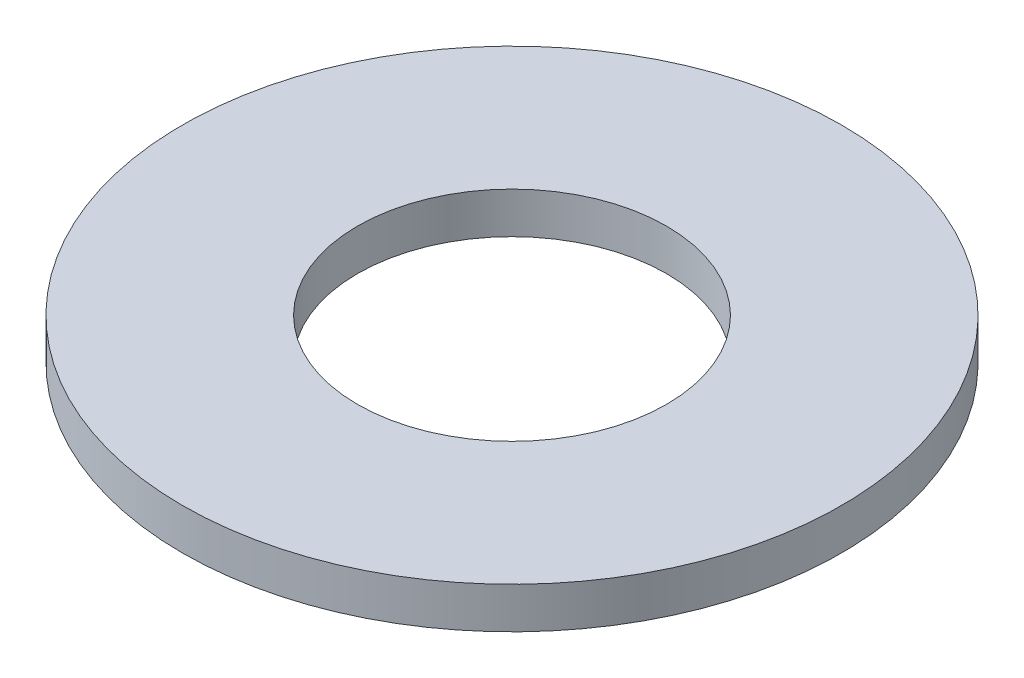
from build123d import *

# Parameters (mm, degrees)
SKETCH1_R          = 50.8
EXTRUDE1_DEPTH     = 6.35
SKETCH2_R          = 23.8125
CUT_EXTRUDE1_DEPTH = 6.35


with BuildPart() as part:
    # Sketch1 → Extrude1 (new body)
    with BuildSketch(Plane(origin=(0, 0, 0), x_dir=(1, 0, 0), z_dir=(0, 1, 0))):
        with Locations(Location((0, 0, 0), (0, 0, 270))):
            Circle(SKETCH1_R)
    extrude(amount=EXTRUDE1_DEPTH)

    # Sketch2 → Cut-Extrude1 (cut)
    with BuildSketch(Plane(origin=(0, 6.35, 0), x_dir=(1, 0, 0), z_dir=(0, 1, 0))):
        with Locations(Location((0, 0, 0), (0, 0, 270))):
            Circle(SKETCH2_R)
    extrude(amount=-CUT_EXTRUDE1_DEPTH, mode=Mode.SUBTRACT)


solid = part.part
